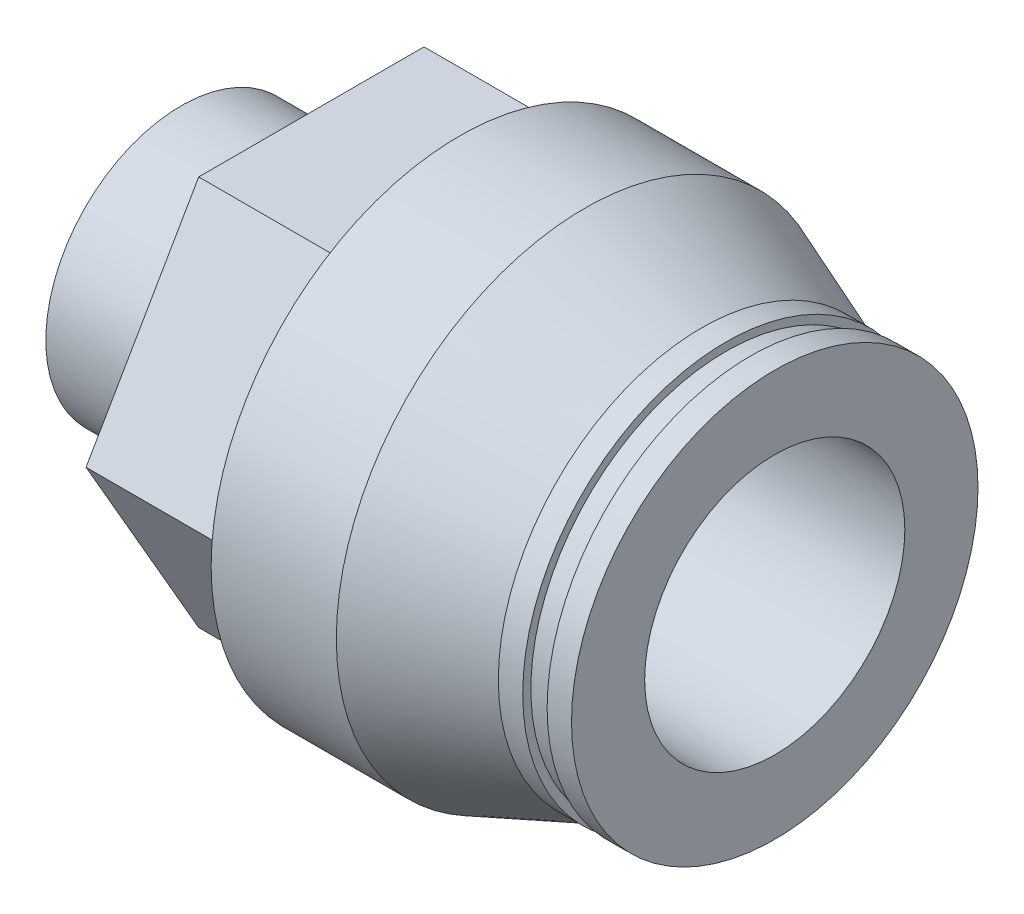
ISO-10303-21;
HEADER;
FILE_DESCRIPTION(('STEP AP214'),'2;1');
FILE_NAME('part.step','',(''),(''),'','','');
FILE_SCHEMA(('AUTOMOTIVE_DESIGN { 1 0 10303 214 1 1 1 1 }'));
ENDSEC;
DATA;
#1=APPLICATION_CONTEXT('core data for automotive mechanical design processes');
#2=APPLICATION_PROTOCOL_DEFINITION('international standard','automotive_design',2000,#1);
#3=PRODUCT_CONTEXT('',#1,'mechanical');
#4=PRODUCT('Part','Part','',(#3));
#5=PRODUCT_RELATED_PRODUCT_CATEGORY('part','',(#4));
#6=PRODUCT_DEFINITION_FORMATION('','',#4);
#7=PRODUCT_DEFINITION_CONTEXT('part definition',#1,'design');
#8=PRODUCT_DEFINITION('design','',#6,#7);
#9=PRODUCT_DEFINITION_SHAPE('','',#8);
#10=(LENGTH_UNIT() NAMED_UNIT(*) SI_UNIT(.MILLI.,.METRE.));
#11=(NAMED_UNIT(*) PLANE_ANGLE_UNIT() SI_UNIT($,.RADIAN.));
#12=(NAMED_UNIT(*) SI_UNIT($,.STERADIAN.) SOLID_ANGLE_UNIT());
#13=UNCERTAINTY_MEASURE_WITH_UNIT(LENGTH_MEASURE(1.E-05),#10,'distance_accuracy_value','');
#14=(GEOMETRIC_REPRESENTATION_CONTEXT(3) GLOBAL_UNCERTAINTY_ASSIGNED_CONTEXT((#13)) GLOBAL_UNIT_ASSIGNED_CONTEXT((#10,
#11,#12)) REPRESENTATION_CONTEXT('',''));
#15=CARTESIAN_POINT('',(0.,0.,0.));
#16=DIRECTION('',(0.,0.,1.));
#17=DIRECTION('',(1.,0.,0.));
#18=AXIS2_PLACEMENT_3D('',#15,#16,#17);
#19=CARTESIAN_POINT('',(8.,8.33,0.));
#20=DIRECTION('',(-1.,0.,0.));
#21=DIRECTION('',(0.,0.,1.));
#22=AXIS2_PLACEMENT_3D('',#19,#20,#21);
#23=PLANE('',#22);
#24=CARTESIAN_POINT('',(8.,0.,0.));
#25=DIRECTION('',(1.,0.,0.));
#26=DIRECTION('',(0.,0.,-1.));
#27=AXIS2_PLACEMENT_3D('',#24,#25,#26);
#28=CIRCLE('',#27,8.33);
#29=CARTESIAN_POINT('',(8.,0.,-8.33));
#30=VERTEX_POINT('',#29);
#31=EDGE_CURVE('E218',#30,#30,#28,.T.);
#32=ORIENTED_EDGE('',*,*,#31,.T.);
#33=EDGE_LOOP('',(#32));
#34=FACE_BOUND('',#33,.T.);
#35=DIRECTION('',(0.,-0.866025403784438,0.5));
#36=VECTOR('',#35,1.);
#37=CARTESIAN_POINT('',(8.,0.,-13.856406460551));
#38=LINE('',#37,#36);
#39=CARTESIAN_POINT('',(8.,0.,-13.856406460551));
#40=VERTEX_POINT('',#39);
#41=CARTESIAN_POINT('',(8.,-12.,-6.9282032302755));
#42=VERTEX_POINT('',#41);
#43=EDGE_CURVE('E127',#40,#42,#38,.T.);
#44=ORIENTED_EDGE('',*,*,#43,.T.);
#45=DIRECTION('',(0.,0.,1.));
#46=VECTOR('',#45,1.);
#47=CARTESIAN_POINT('',(8.,-12.,-6.9282032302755));
#48=LINE('',#47,#46);
#49=CARTESIAN_POINT('',(8.,-12.,6.92820323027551));
#50=VERTEX_POINT('',#49);
#51=EDGE_CURVE('E110',#42,#50,#48,.T.);
#52=ORIENTED_EDGE('',*,*,#51,.T.);
#53=DIRECTION('',(0.,0.866025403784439,0.5));
#54=VECTOR('',#53,1.);
#55=CARTESIAN_POINT('',(8.,-12.,6.92820323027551));
#56=LINE('',#55,#54);
#57=CARTESIAN_POINT('',(8.,0.,13.856406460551));
#58=VERTEX_POINT('',#57);
#59=EDGE_CURVE('E121',#50,#58,#56,.T.);
#60=ORIENTED_EDGE('',*,*,#59,.T.);
#61=DIRECTION('',(0.,0.866025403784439,-0.5));
#62=VECTOR('',#61,1.);
#63=CARTESIAN_POINT('',(8.,0.,13.856406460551));
#64=LINE('',#63,#62);
#65=CARTESIAN_POINT('',(8.,12.,6.92820323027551));
#66=VERTEX_POINT('',#65);
#67=EDGE_CURVE('E30',#58,#66,#64,.T.);
#68=ORIENTED_EDGE('',*,*,#67,.T.);
#69=DIRECTION('',(0.,0.,-1.));
#70=VECTOR('',#69,1.);
#71=CARTESIAN_POINT('',(8.,12.,6.92820323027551));
#72=LINE('',#71,#70);
#73=CARTESIAN_POINT('',(8.,12.,-6.92820323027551));
#74=VERTEX_POINT('',#73);
#75=EDGE_CURVE('E131',#66,#74,#72,.T.);
#76=ORIENTED_EDGE('',*,*,#75,.T.);
#77=DIRECTION('',(0.,-0.866025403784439,-0.5));
#78=VECTOR('',#77,1.);
#79=CARTESIAN_POINT('',(8.,12.,-6.92820323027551));
#80=LINE('',#79,#78);
#81=EDGE_CURVE('E134',#74,#40,#80,.T.);
#82=ORIENTED_EDGE('',*,*,#81,.T.);
#83=EDGE_LOOP('',(#44,#52,#60,#68,#76,#82));
#84=FACE_BOUND('',#83,.T.);
#85=ADVANCED_FACE('F15',(#34,#84),#23,.T.);
#86=CARTESIAN_POINT('',(0.,0.,0.));
#87=DIRECTION('',(-1.,0.,0.));
#88=DIRECTION('',(0.,0.,1.));
#89=AXIS2_PLACEMENT_3D('',#86,#87,#88);
#90=PLANE('',#89);
#91=CARTESIAN_POINT('',(0.,0.,0.));
#92=DIRECTION('',(1.,0.,0.));
#93=DIRECTION('',(0.,0.,-1.));
#94=AXIS2_PLACEMENT_3D('',#91,#92,#93);
#95=CIRCLE('',#94,8.33);
#96=CARTESIAN_POINT('',(0.,0.,-8.33));
#97=VERTEX_POINT('',#96);
#98=EDGE_CURVE('E221',#97,#97,#95,.T.);
#99=ORIENTED_EDGE('',*,*,#98,.F.);
#100=EDGE_LOOP('',(#99));
#101=FACE_BOUND('',#100,.T.);
#102=DIRECTION('',(0.,-0.866025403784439,-0.5));
#103=VECTOR('',#102,1.);
#104=CARTESIAN_POINT('',(0.,0.,4.618802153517));
#105=LINE('',#104,#103);
#106=CARTESIAN_POINT('',(0.,0.,4.618802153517));
#107=VERTEX_POINT('',#106);
#108=CARTESIAN_POINT('',(0.,-4.,2.3094010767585));
#109=VERTEX_POINT('',#108);
#110=EDGE_CURVE('E173',#107,#109,#105,.T.);
#111=ORIENTED_EDGE('',*,*,#110,.T.);
#112=DIRECTION('',(0.,0.,-1.));
#113=VECTOR('',#112,1.);
#114=CARTESIAN_POINT('',(0.,-4.,2.3094010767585));
#115=LINE('',#114,#113);
#116=CARTESIAN_POINT('',(0.,-4.,-2.30940107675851));
#117=VERTEX_POINT('',#116);
#118=EDGE_CURVE('E38',#109,#117,#115,.T.);
#119=ORIENTED_EDGE('',*,*,#118,.T.);
#120=DIRECTION('',(0.,0.866025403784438,-0.5));
#121=VECTOR('',#120,1.);
#122=CARTESIAN_POINT('',(0.,-4.,-2.30940107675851));
#123=LINE('',#122,#121);
#124=CARTESIAN_POINT('',(0.,0.,-4.61880215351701));
#125=VERTEX_POINT('',#124);
#126=EDGE_CURVE('E161',#117,#125,#123,.T.);
#127=ORIENTED_EDGE('',*,*,#126,.T.);
#128=DIRECTION('',(0.,0.866025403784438,0.5));
#129=VECTOR('',#128,1.);
#130=CARTESIAN_POINT('',(0.,0.,-4.61880215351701));
#131=LINE('',#130,#129);
#132=CARTESIAN_POINT('',(0.,4.,-2.3094010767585));
#133=VERTEX_POINT('',#132);
#134=EDGE_CURVE('E164',#125,#133,#131,.T.);
#135=ORIENTED_EDGE('',*,*,#134,.T.);
#136=DIRECTION('',(0.,0.,1.));
#137=VECTOR('',#136,1.);
#138=CARTESIAN_POINT('',(0.,4.,-2.3094010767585));
#139=LINE('',#138,#137);
#140=CARTESIAN_POINT('',(0.,4.,2.3094010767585));
#141=VERTEX_POINT('',#140);
#142=EDGE_CURVE('E167',#133,#141,#139,.T.);
#143=ORIENTED_EDGE('',*,*,#142,.T.);
#144=DIRECTION('',(0.,-0.866025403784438,0.5));
#145=VECTOR('',#144,1.);
#146=CARTESIAN_POINT('',(0.,4.,2.3094010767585));
#147=LINE('',#146,#145);
#148=EDGE_CURVE('E170',#141,#107,#147,.T.);
#149=ORIENTED_EDGE('',*,*,#148,.T.);
#150=EDGE_LOOP('',(#111,#119,#127,#135,#143,#149));
#151=FACE_BOUND('',#150,.T.);
#152=ADVANCED_FACE('F17',(#101,#151),#90,.T.);
#153=CARTESIAN_POINT('',(11.5,8.,0.));
#154=DIRECTION('',(1.,0.,0.));
#155=DIRECTION('',(0.,0.,-1.));
#156=AXIS2_PLACEMENT_3D('',#153,#154,#155);
#157=PLANE('',#156);
#158=CARTESIAN_POINT('',(11.5,0.,0.));
#159=DIRECTION('',(1.,0.,0.));
#160=DIRECTION('',(0.,0.,-1.));
#161=AXIS2_PLACEMENT_3D('',#158,#159,#160);
#162=CIRCLE('',#161,8.);
#163=CARTESIAN_POINT('',(11.5,0.,-8.));
#164=VERTEX_POINT('',#163);
#165=EDGE_CURVE('E188',#164,#164,#162,.T.);
#166=ORIENTED_EDGE('',*,*,#165,.T.);
#167=EDGE_LOOP('',(#166));
#168=FACE_BOUND('',#167,.T.);
#169=DIRECTION('',(0.,-0.866025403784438,0.5));
#170=VECTOR('',#169,1.);
#171=CARTESIAN_POINT('',(11.5,3.99999999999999,-6.92820323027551));
#172=LINE('',#171,#170);
#173=CARTESIAN_POINT('',(11.5,0.,-4.61880215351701));
#174=VERTEX_POINT('',#173);
#175=CARTESIAN_POINT('',(11.5,-4.,-2.30940107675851));
#176=VERTEX_POINT('',#175);
#177=EDGE_CURVE('E23',#174,#176,#172,.T.);
#178=ORIENTED_EDGE('',*,*,#177,.T.);
#179=DIRECTION('',(0.,0.,1.));
#180=VECTOR('',#179,1.);
#181=CARTESIAN_POINT('',(11.5,-4.,0.));
#182=LINE('',#181,#180);
#183=CARTESIAN_POINT('',(11.5,-4.,2.3094010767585));
#184=VERTEX_POINT('',#183);
#185=EDGE_CURVE('E9',#176,#184,#182,.T.);
#186=ORIENTED_EDGE('',*,*,#185,.T.);
#187=DIRECTION('',(0.,0.866025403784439,0.5));
#188=VECTOR('',#187,1.);
#189=CARTESIAN_POINT('',(11.5,4.,6.92820323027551));
#190=LINE('',#189,#188);
#191=CARTESIAN_POINT('',(11.5,0.,4.618802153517));
#192=VERTEX_POINT('',#191);
#193=EDGE_CURVE('E224',#184,#192,#190,.T.);
#194=ORIENTED_EDGE('',*,*,#193,.T.);
#195=DIRECTION('',(0.,0.866025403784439,-0.5));
#196=VECTOR('',#195,1.);
#197=CARTESIAN_POINT('',(11.5,8.,0.));
#198=LINE('',#197,#196);
#199=CARTESIAN_POINT('',(11.5,4.,2.3094010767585));
#200=VERTEX_POINT('',#199);
#201=EDGE_CURVE('E227',#192,#200,#198,.T.);
#202=ORIENTED_EDGE('',*,*,#201,.T.);
#203=DIRECTION('',(0.,0.,-1.));
#204=VECTOR('',#203,1.);
#205=CARTESIAN_POINT('',(11.5,4.,0.));
#206=LINE('',#205,#204);
#207=CARTESIAN_POINT('',(11.5,4.,-2.3094010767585));
#208=VERTEX_POINT('',#207);
#209=EDGE_CURVE('E230',#200,#208,#206,.T.);
#210=ORIENTED_EDGE('',*,*,#209,.T.);
#211=DIRECTION('',(0.,-0.866025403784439,-0.5));
#212=VECTOR('',#211,1.);
#213=CARTESIAN_POINT('',(11.5,8.,0.));
#214=LINE('',#213,#212);
#215=EDGE_CURVE('E233',#208,#174,#214,.T.);
#216=ORIENTED_EDGE('',*,*,#215,.T.);
#217=EDGE_LOOP('',(#178,#186,#194,#202,#210,#216));
#218=FACE_BOUND('',#217,.T.);
#219=ADVANCED_FACE('F237',(#168,#218),#157,.T.);
#220=CARTESIAN_POINT('',(0.,0.,0.));
#221=DIRECTION('',(1.,0.,0.));
#222=DIRECTION('',(0.,0.,-1.));
#223=AXIS2_PLACEMENT_3D('',#220,#221,#222);
#224=CYLINDRICAL_SURFACE('',#223,8.33);
#225=ORIENTED_EDGE('',*,*,#98,.T.);
#226=EDGE_LOOP('',(#225));
#227=FACE_BOUND('',#226,.T.);
#228=ORIENTED_EDGE('',*,*,#31,.F.);
#229=EDGE_LOOP('',(#228));
#230=FACE_BOUND('',#229,.T.);
#231=ADVANCED_FACE('F279',(#227,#230),#224,.T.);
#232=CARTESIAN_POINT('',(17.125,14.,0.));
#233=DIRECTION('',(-1.,0.,0.));
#234=DIRECTION('',(0.,0.,1.));
#235=AXIS2_PLACEMENT_3D('',#232,#233,#234);
#236=PLANE('',#235);
#237=CARTESIAN_POINT('',(17.125,0.,0.));
#238=DIRECTION('',(1.,0.,0.));
#239=DIRECTION('',(0.,0.,-1.));
#240=AXIS2_PLACEMENT_3D('',#237,#238,#239);
#241=CIRCLE('',#240,15.2875847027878);
#242=CARTESIAN_POINT('',(17.125,0.,-15.2875847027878));
#243=VERTEX_POINT('',#242);
#244=EDGE_CURVE('E215',#243,#243,#241,.T.);
#245=ORIENTED_EDGE('',*,*,#244,.F.);
#246=EDGE_LOOP('',(#245));
#247=FACE_BOUND('',#246,.T.);
#248=DIRECTION('',(0.,-0.866025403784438,0.5));
#249=VECTOR('',#248,1.);
#250=CARTESIAN_POINT('',(17.125,0.,-13.856406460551));
#251=LINE('',#250,#249);
#252=CARTESIAN_POINT('',(17.125,0.,-13.856406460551));
#253=VERTEX_POINT('',#252);
#254=CARTESIAN_POINT('',(17.125,-12.,-6.9282032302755));
#255=VERTEX_POINT('',#254);
#256=EDGE_CURVE('E118',#253,#255,#251,.T.);
#257=ORIENTED_EDGE('',*,*,#256,.F.);
#258=DIRECTION('',(0.,-0.866025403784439,-0.5));
#259=VECTOR('',#258,1.);
#260=CARTESIAN_POINT('',(17.125,12.,-6.92820323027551));
#261=LINE('',#260,#259);
#262=CARTESIAN_POINT('',(17.125,12.,-6.92820323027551));
#263=VERTEX_POINT('',#262);
#264=EDGE_CURVE('E146',#263,#253,#261,.T.);
#265=ORIENTED_EDGE('',*,*,#264,.F.);
#266=DIRECTION('',(0.,0.,-1.));
#267=VECTOR('',#266,1.);
#268=CARTESIAN_POINT('',(17.125,12.,6.92820323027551));
#269=LINE('',#268,#267);
#270=CARTESIAN_POINT('',(17.125,12.,6.92820323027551));
#271=VERTEX_POINT('',#270);
#272=EDGE_CURVE('E143',#271,#263,#269,.T.);
#273=ORIENTED_EDGE('',*,*,#272,.F.);
#274=DIRECTION('',(0.,0.866025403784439,-0.5));
#275=VECTOR('',#274,1.);
#276=CARTESIAN_POINT('',(17.125,0.,13.856406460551));
#277=LINE('',#276,#275);
#278=CARTESIAN_POINT('',(17.125,0.,13.856406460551));
#279=VERTEX_POINT('',#278);
#280=EDGE_CURVE('E140',#279,#271,#277,.T.);
#281=ORIENTED_EDGE('',*,*,#280,.F.);
#282=DIRECTION('',(0.,0.866025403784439,0.5));
#283=VECTOR('',#282,1.);
#284=CARTESIAN_POINT('',(17.125,-12.,6.92820323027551));
#285=LINE('',#284,#283);
#286=CARTESIAN_POINT('',(17.125,-12.,6.92820323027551));
#287=VERTEX_POINT('',#286);
#288=EDGE_CURVE('E138',#287,#279,#285,.T.);
#289=ORIENTED_EDGE('',*,*,#288,.F.);
#290=DIRECTION('',(0.,0.,1.));
#291=VECTOR('',#290,1.);
#292=CARTESIAN_POINT('',(17.125,-12.,-6.9282032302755));
#293=LINE('',#292,#291);
#294=EDGE_CURVE('E113',#255,#287,#293,.T.);
#295=ORIENTED_EDGE('',*,*,#294,.F.);
#296=EDGE_LOOP('',(#257,#265,#273,#281,#289,#295));
#297=FACE_BOUND('',#296,.T.);
#298=ADVANCED_FACE('F277',(#247,#297),#236,.T.);
#299=CARTESIAN_POINT('',(0.,0.,0.));
#300=DIRECTION('',(1.,0.,0.));
#301=DIRECTION('',(0.,0.,-1.));
#302=AXIS2_PLACEMENT_3D('',#299,#300,#301);
#303=CYLINDRICAL_SURFACE('',#302,15.2875847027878);
#304=ORIENTED_EDGE('',*,*,#244,.T.);
#305=EDGE_LOOP('',(#304));
#306=FACE_BOUND('',#305,.T.);
#307=CARTESIAN_POINT('',(24.8236975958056,0.,0.));
#308=DIRECTION('',(1.,0.,0.));
#309=DIRECTION('',(0.,0.,-1.));
#310=AXIS2_PLACEMENT_3D('',#307,#308,#309);
#311=CIRCLE('',#310,15.2875847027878);
#312=CARTESIAN_POINT('',(24.8236975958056,0.,-15.2875847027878));
#313=VERTEX_POINT('',#312);
#314=EDGE_CURVE('E212',#313,#313,#311,.T.);
#315=ORIENTED_EDGE('',*,*,#314,.F.);
#316=EDGE_LOOP('',(#315));
#317=FACE_BOUND('',#316,.T.);
#318=ADVANCED_FACE('F286',(#306,#317),#303,.T.);
#319=CARTESIAN_POINT('',(32.,0.,0.));
#320=DIRECTION('',(-1.,0.,0.));
#321=DIRECTION('',(0.,0.,1.));
#322=AXIS2_PLACEMENT_3D('',#319,#320,#321);
#323=CONICAL_SURFACE('',#322,12.5,0.370503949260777);
#324=ORIENTED_EDGE('',*,*,#314,.T.);
#325=EDGE_LOOP('',(#324));
#326=FACE_BOUND('',#325,.T.);
#327=CARTESIAN_POINT('',(32.,0.,0.));
#328=DIRECTION('',(1.,0.,0.));
#329=DIRECTION('',(0.,0.,-1.));
#330=AXIS2_PLACEMENT_3D('',#327,#328,#329);
#331=CIRCLE('',#330,12.5);
#332=CARTESIAN_POINT('',(32.,0.,-12.5));
#333=VERTEX_POINT('',#332);
#334=EDGE_CURVE('E209',#333,#333,#331,.T.);
#335=ORIENTED_EDGE('',*,*,#334,.F.);
#336=EDGE_LOOP('',(#335));
#337=FACE_BOUND('',#336,.T.);
#338=ADVANCED_FACE('F317',(#326,#337),#323,.T.);
#339=CARTESIAN_POINT('',(0.,0.,0.));
#340=DIRECTION('',(1.,0.,0.));
#341=DIRECTION('',(0.,0.,-1.));
#342=AXIS2_PLACEMENT_3D('',#339,#340,#341);
#343=CYLINDRICAL_SURFACE('',#342,12.5);
#344=ORIENTED_EDGE('',*,*,#334,.T.);
#345=EDGE_LOOP('',(#344));
#346=FACE_BOUND('',#345,.T.);
#347=CARTESIAN_POINT('',(33.5,0.,0.));
#348=DIRECTION('',(1.,0.,0.));
#349=DIRECTION('',(0.,0.,-1.));
#350=AXIS2_PLACEMENT_3D('',#347,#348,#349);
#351=CIRCLE('',#350,12.5);
#352=CARTESIAN_POINT('',(33.5,0.,-12.5));
#353=VERTEX_POINT('',#352);
#354=EDGE_CURVE('E206',#353,#353,#351,.T.);
#355=ORIENTED_EDGE('',*,*,#354,.F.);
#356=EDGE_LOOP('',(#355));
#357=FACE_BOUND('',#356,.T.);
#358=ADVANCED_FACE('F313',(#346,#357),#343,.T.);
#359=CARTESIAN_POINT('',(33.5,12.5,0.));
#360=DIRECTION('',(1.,0.,0.));
#361=DIRECTION('',(0.,0.,-1.));
#362=AXIS2_PLACEMENT_3D('',#359,#360,#361);
#363=PLANE('',#362);
#364=ORIENTED_EDGE('',*,*,#354,.T.);
#365=EDGE_LOOP('',(#364));
#366=FACE_BOUND('',#365,.T.);
#367=CARTESIAN_POINT('',(33.5,0.,0.));
#368=DIRECTION('',(1.,0.,0.));
#369=DIRECTION('',(0.,0.,-1.));
#370=AXIS2_PLACEMENT_3D('',#367,#368,#369);
#371=CIRCLE('',#370,12.);
#372=CARTESIAN_POINT('',(33.5,0.,-12.));
#373=VERTEX_POINT('',#372);
#374=EDGE_CURVE('E203',#373,#373,#371,.T.);
#375=ORIENTED_EDGE('',*,*,#374,.F.);
#376=EDGE_LOOP('',(#375));
#377=FACE_BOUND('',#376,.T.);
#378=ADVANCED_FACE('F309',(#366,#377),#363,.T.);
#379=CARTESIAN_POINT('',(0.,0.,0.));
#380=DIRECTION('',(1.,0.,0.));
#381=DIRECTION('',(0.,0.,-1.));
#382=AXIS2_PLACEMENT_3D('',#379,#380,#381);
#383=CYLINDRICAL_SURFACE('',#382,12.);
#384=ORIENTED_EDGE('',*,*,#374,.T.);
#385=EDGE_LOOP('',(#384));
#386=FACE_BOUND('',#385,.T.);
#387=CARTESIAN_POINT('',(35.,0.,0.));
#388=DIRECTION('',(1.,0.,0.));
#389=DIRECTION('',(0.,0.,-1.));
#390=AXIS2_PLACEMENT_3D('',#387,#388,#389);
#391=CIRCLE('',#390,12.);
#392=CARTESIAN_POINT('',(35.,0.,-12.));
#393=VERTEX_POINT('',#392);
#394=EDGE_CURVE('E200',#393,#393,#391,.T.);
#395=ORIENTED_EDGE('',*,*,#394,.F.);
#396=EDGE_LOOP('',(#395));
#397=FACE_BOUND('',#396,.T.);
#398=ADVANCED_FACE('F305',(#386,#397),#383,.T.);
#399=CARTESIAN_POINT('',(35.,12.,0.));
#400=DIRECTION('',(-1.,0.,0.));
#401=DIRECTION('',(0.,0.,1.));
#402=AXIS2_PLACEMENT_3D('',#399,#400,#401);
#403=PLANE('',#402);
#404=ORIENTED_EDGE('',*,*,#394,.T.);
#405=EDGE_LOOP('',(#404));
#406=FACE_BOUND('',#405,.T.);
#407=CARTESIAN_POINT('',(35.,0.,0.));
#408=DIRECTION('',(1.,0.,0.));
#409=DIRECTION('',(0.,0.,-1.));
#410=AXIS2_PLACEMENT_3D('',#407,#408,#409);
#411=CIRCLE('',#410,12.5);
#412=CARTESIAN_POINT('',(35.,0.,-12.5));
#413=VERTEX_POINT('',#412);
#414=EDGE_CURVE('E197',#413,#413,#411,.T.);
#415=ORIENTED_EDGE('',*,*,#414,.F.);
#416=EDGE_LOOP('',(#415));
#417=FACE_BOUND('',#416,.T.);
#418=ADVANCED_FACE('F301',(#406,#417),#403,.T.);
#419=CARTESIAN_POINT('',(0.,0.,0.));
#420=DIRECTION('',(1.,0.,0.));
#421=DIRECTION('',(0.,0.,-1.));
#422=AXIS2_PLACEMENT_3D('',#419,#420,#421);
#423=CYLINDRICAL_SURFACE('',#422,12.5);
#424=ORIENTED_EDGE('',*,*,#414,.T.);
#425=EDGE_LOOP('',(#424));
#426=FACE_BOUND('',#425,.T.);
#427=CARTESIAN_POINT('',(36.5,0.,0.));
#428=DIRECTION('',(1.,0.,0.));
#429=DIRECTION('',(0.,0.,-1.));
#430=AXIS2_PLACEMENT_3D('',#427,#428,#429);
#431=CIRCLE('',#430,12.5);
#432=CARTESIAN_POINT('',(36.5,0.,-12.5));
#433=VERTEX_POINT('',#432);
#434=EDGE_CURVE('E194',#433,#433,#431,.T.);
#435=ORIENTED_EDGE('',*,*,#434,.F.);
#436=EDGE_LOOP('',(#435));
#437=FACE_BOUND('',#436,.T.);
#438=ADVANCED_FACE('F297',(#426,#437),#423,.T.);
#439=CARTESIAN_POINT('',(36.5,12.5,0.));
#440=DIRECTION('',(1.,0.,0.));
#441=DIRECTION('',(0.,0.,-1.));
#442=AXIS2_PLACEMENT_3D('',#439,#440,#441);
#443=PLANE('',#442);
#444=ORIENTED_EDGE('',*,*,#434,.T.);
#445=EDGE_LOOP('',(#444));
#446=FACE_BOUND('',#445,.T.);
#447=CARTESIAN_POINT('',(36.5,0.,0.));
#448=DIRECTION('',(1.,0.,0.));
#449=DIRECTION('',(0.,0.,-1.));
#450=AXIS2_PLACEMENT_3D('',#447,#448,#449);
#451=CIRCLE('',#450,8.);
#452=CARTESIAN_POINT('',(36.5,0.,-8.));
#453=VERTEX_POINT('',#452);
#454=EDGE_CURVE('E191',#453,#453,#451,.T.);
#455=ORIENTED_EDGE('',*,*,#454,.F.);
#456=EDGE_LOOP('',(#455));
#457=FACE_BOUND('',#456,.T.);
#458=ADVANCED_FACE('F265',(#446,#457),#443,.T.);
#459=CARTESIAN_POINT('',(0.,0.,0.));
#460=DIRECTION('',(1.,0.,0.));
#461=DIRECTION('',(0.,0.,-1.));
#462=AXIS2_PLACEMENT_3D('',#459,#460,#461);
#463=CYLINDRICAL_SURFACE('',#462,8.);
#464=ORIENTED_EDGE('',*,*,#454,.T.);
#465=EDGE_LOOP('',(#464));
#466=FACE_BOUND('',#465,.T.);
#467=ORIENTED_EDGE('',*,*,#165,.F.);
#468=EDGE_LOOP('',(#467));
#469=FACE_BOUND('',#468,.T.);
#470=ADVANCED_FACE('F256',(#466,#469),#463,.F.);
#471=CARTESIAN_POINT('',(36.5,-4.,2.3094010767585));
#472=DIRECTION('',(0.,1.,0.));
#473=DIRECTION('',(0.,0.,1.));
#474=AXIS2_PLACEMENT_3D('',#471,#472,#473);
#475=PLANE('',#474);
#476=DIRECTION('',(-1.,0.,0.));
#477=VECTOR('',#476,1.);
#478=CARTESIAN_POINT('',(36.5,-4.,-2.30940107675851));
#479=LINE('',#478,#477);
#480=EDGE_CURVE('E186',#176,#117,#479,.T.);
#481=ORIENTED_EDGE('',*,*,#480,.T.);
#482=ORIENTED_EDGE('',*,*,#118,.F.);
#483=DIRECTION('',(-1.,0.,0.));
#484=VECTOR('',#483,1.);
#485=CARTESIAN_POINT('',(36.5,-4.,2.3094010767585));
#486=LINE('',#485,#484);
#487=EDGE_CURVE('E176',#184,#109,#486,.T.);
#488=ORIENTED_EDGE('',*,*,#487,.F.);
#489=ORIENTED_EDGE('',*,*,#185,.F.);
#490=EDGE_LOOP('',(#481,#482,#488,#489));
#491=FACE_BOUND('',#490,.T.);
#492=ADVANCED_FACE('F254',(#491),#475,.T.);
#493=CARTESIAN_POINT('',(36.5,-4.,-2.30940107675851));
#494=DIRECTION('',(0.,0.5,0.866025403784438));
#495=DIRECTION('',(0.,-0.866025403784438,0.5));
#496=AXIS2_PLACEMENT_3D('',#493,#494,#495);
#497=PLANE('',#496);
#498=DIRECTION('',(-1.,0.,0.));
#499=VECTOR('',#498,1.);
#500=CARTESIAN_POINT('',(36.5,0.,-4.61880215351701));
#501=LINE('',#500,#499);
#502=EDGE_CURVE('E184',#174,#125,#501,.T.);
#503=ORIENTED_EDGE('',*,*,#502,.T.);
#504=ORIENTED_EDGE('',*,*,#126,.F.);
#505=ORIENTED_EDGE('',*,*,#480,.F.);
#506=ORIENTED_EDGE('',*,*,#177,.F.);
#507=EDGE_LOOP('',(#503,#504,#505,#506));
#508=FACE_BOUND('',#507,.T.);
#509=ADVANCED_FACE('F241',(#508),#497,.T.);
#510=CARTESIAN_POINT('',(36.5,0.,-4.61880215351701));
#511=DIRECTION('',(0.,-0.5,0.866025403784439));
#512=DIRECTION('',(0.,-0.866025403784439,-0.5));
#513=AXIS2_PLACEMENT_3D('',#510,#511,#512);
#514=PLANE('',#513);
#515=DIRECTION('',(-1.,0.,0.));
#516=VECTOR('',#515,1.);
#517=CARTESIAN_POINT('',(36.5,4.,-2.3094010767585));
#518=LINE('',#517,#516);
#519=EDGE_CURVE('E182',#208,#133,#518,.T.);
#520=ORIENTED_EDGE('',*,*,#519,.T.);
#521=ORIENTED_EDGE('',*,*,#134,.F.);
#522=ORIENTED_EDGE('',*,*,#502,.F.);
#523=ORIENTED_EDGE('',*,*,#215,.F.);
#524=EDGE_LOOP('',(#520,#521,#522,#523));
#525=FACE_BOUND('',#524,.T.);
#526=ADVANCED_FACE('F245',(#525),#514,.T.);
#527=CARTESIAN_POINT('',(36.5,4.,-2.3094010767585));
#528=DIRECTION('',(0.,-1.,0.));
#529=DIRECTION('',(0.,0.,-1.));
#530=AXIS2_PLACEMENT_3D('',#527,#528,#529);
#531=PLANE('',#530);
#532=DIRECTION('',(-1.,0.,0.));
#533=VECTOR('',#532,1.);
#534=CARTESIAN_POINT('',(36.5,4.,2.3094010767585));
#535=LINE('',#534,#533);
#536=EDGE_CURVE('E180',#200,#141,#535,.T.);
#537=ORIENTED_EDGE('',*,*,#536,.T.);
#538=ORIENTED_EDGE('',*,*,#142,.F.);
#539=ORIENTED_EDGE('',*,*,#519,.F.);
#540=ORIENTED_EDGE('',*,*,#209,.F.);
#541=EDGE_LOOP('',(#537,#538,#539,#540));
#542=FACE_BOUND('',#541,.T.);
#543=ADVANCED_FACE('F374',(#542),#531,.T.);
#544=CARTESIAN_POINT('',(36.5,4.,2.3094010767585));
#545=DIRECTION('',(0.,-0.5,-0.866025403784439));
#546=DIRECTION('',(0.,0.866025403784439,-0.5));
#547=AXIS2_PLACEMENT_3D('',#544,#545,#546);
#548=PLANE('',#547);
#549=DIRECTION('',(-1.,0.,0.));
#550=VECTOR('',#549,1.);
#551=CARTESIAN_POINT('',(36.5,0.,4.618802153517));
#552=LINE('',#551,#550);
#553=EDGE_CURVE('E178',#192,#107,#552,.T.);
#554=ORIENTED_EDGE('',*,*,#553,.T.);
#555=ORIENTED_EDGE('',*,*,#148,.F.);
#556=ORIENTED_EDGE('',*,*,#536,.F.);
#557=ORIENTED_EDGE('',*,*,#201,.F.);
#558=EDGE_LOOP('',(#554,#555,#556,#557));
#559=FACE_BOUND('',#558,.T.);
#560=ADVANCED_FACE('F371',(#559),#548,.T.);
#561=CARTESIAN_POINT('',(36.5,0.,4.618802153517));
#562=DIRECTION('',(0.,0.5,-0.866025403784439));
#563=DIRECTION('',(0.,0.866025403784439,0.5));
#564=AXIS2_PLACEMENT_3D('',#561,#562,#563);
#565=PLANE('',#564);
#566=ORIENTED_EDGE('',*,*,#487,.T.);
#567=ORIENTED_EDGE('',*,*,#110,.F.);
#568=ORIENTED_EDGE('',*,*,#553,.F.);
#569=ORIENTED_EDGE('',*,*,#193,.F.);
#570=EDGE_LOOP('',(#566,#567,#568,#569));
#571=FACE_BOUND('',#570,.T.);
#572=ADVANCED_FACE('F252',(#571),#565,.T.);
#573=CARTESIAN_POINT('',(17.125,-12.,-6.9282032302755));
#574=DIRECTION('',(0.,-1.,0.));
#575=DIRECTION('',(0.,0.,-1.));
#576=AXIS2_PLACEMENT_3D('',#573,#574,#575);
#577=PLANE('',#576);
#578=DIRECTION('',(-1.,0.,0.));
#579=VECTOR('',#578,1.);
#580=CARTESIAN_POINT('',(17.125,-12.,-6.9282032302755));
#581=LINE('',#580,#579);
#582=EDGE_CURVE('E151',#255,#42,#581,.T.);
#583=ORIENTED_EDGE('',*,*,#582,.F.);
#584=ORIENTED_EDGE('',*,*,#294,.T.);
#585=DIRECTION('',(-1.,0.,0.));
#586=VECTOR('',#585,1.);
#587=CARTESIAN_POINT('',(17.125,-12.,6.92820323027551));
#588=LINE('',#587,#586);
#589=EDGE_CURVE('E106',#287,#50,#588,.T.);
#590=ORIENTED_EDGE('',*,*,#589,.T.);
#591=ORIENTED_EDGE('',*,*,#51,.F.);
#592=EDGE_LOOP('',(#583,#584,#590,#591));
#593=FACE_BOUND('',#592,.T.);
#594=ADVANCED_FACE('F108',(#593),#577,.T.);
#595=CARTESIAN_POINT('',(17.125,0.,-13.856406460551));
#596=DIRECTION('',(0.,-0.5,-0.866025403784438));
#597=DIRECTION('',(0.,0.866025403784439,-0.5));
#598=AXIS2_PLACEMENT_3D('',#595,#596,#597);
#599=PLANE('',#598);
#600=DIRECTION('',(-1.,0.,0.));
#601=VECTOR('',#600,1.);
#602=CARTESIAN_POINT('',(17.125,0.,-13.856406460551));
#603=LINE('',#602,#601);
#604=EDGE_CURVE('E153',#253,#40,#603,.T.);
#605=ORIENTED_EDGE('',*,*,#604,.F.);
#606=ORIENTED_EDGE('',*,*,#256,.T.);
#607=ORIENTED_EDGE('',*,*,#582,.T.);
#608=ORIENTED_EDGE('',*,*,#43,.F.);
#609=EDGE_LOOP('',(#605,#606,#607,#608));
#610=FACE_BOUND('',#609,.T.);
#611=ADVANCED_FACE('F368',(#610),#599,.T.);
#612=CARTESIAN_POINT('',(17.125,12.,-6.92820323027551));
#613=DIRECTION('',(0.,0.5,-0.866025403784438));
#614=DIRECTION('',(0.,0.866025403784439,0.5));
#615=AXIS2_PLACEMENT_3D('',#612,#613,#614);
#616=PLANE('',#615);
#617=DIRECTION('',(-1.,0.,0.));
#618=VECTOR('',#617,1.);
#619=CARTESIAN_POINT('',(17.125,12.,-6.92820323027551));
#620=LINE('',#619,#618);
#621=EDGE_CURVE('E155',#263,#74,#620,.T.);
#622=ORIENTED_EDGE('',*,*,#621,.F.);
#623=ORIENTED_EDGE('',*,*,#264,.T.);
#624=ORIENTED_EDGE('',*,*,#604,.T.);
#625=ORIENTED_EDGE('',*,*,#81,.F.);
#626=EDGE_LOOP('',(#622,#623,#624,#625));
#627=FACE_BOUND('',#626,.T.);
#628=ADVANCED_FACE('F350',(#627),#616,.T.);
#629=CARTESIAN_POINT('',(17.125,12.,6.92820323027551));
#630=DIRECTION('',(0.,1.,0.));
#631=DIRECTION('',(0.,0.,1.));
#632=AXIS2_PLACEMENT_3D('',#629,#630,#631);
#633=PLANE('',#632);
#634=DIRECTION('',(-1.,0.,0.));
#635=VECTOR('',#634,1.);
#636=CARTESIAN_POINT('',(17.125,12.,6.92820323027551));
#637=LINE('',#636,#635);
#638=EDGE_CURVE('E157',#271,#66,#637,.T.);
#639=ORIENTED_EDGE('',*,*,#638,.F.);
#640=ORIENTED_EDGE('',*,*,#272,.T.);
#641=ORIENTED_EDGE('',*,*,#621,.T.);
#642=ORIENTED_EDGE('',*,*,#75,.F.);
#643=EDGE_LOOP('',(#639,#640,#641,#642));
#644=FACE_BOUND('',#643,.T.);
#645=ADVANCED_FACE('F354',(#644),#633,.T.);
#646=CARTESIAN_POINT('',(17.125,0.,13.856406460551));
#647=DIRECTION('',(0.,0.5,0.866025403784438));
#648=DIRECTION('',(0.,-0.866025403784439,0.5));
#649=AXIS2_PLACEMENT_3D('',#646,#647,#648);
#650=PLANE('',#649);
#651=DIRECTION('',(-1.,0.,0.));
#652=VECTOR('',#651,1.);
#653=CARTESIAN_POINT('',(17.125,0.,13.856406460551));
#654=LINE('',#653,#652);
#655=EDGE_CURVE('E117',#279,#58,#654,.T.);
#656=ORIENTED_EDGE('',*,*,#655,.F.);
#657=ORIENTED_EDGE('',*,*,#280,.T.);
#658=ORIENTED_EDGE('',*,*,#638,.T.);
#659=ORIENTED_EDGE('',*,*,#67,.F.);
#660=EDGE_LOOP('',(#656,#657,#658,#659));
#661=FACE_BOUND('',#660,.T.);
#662=ADVANCED_FACE('F355',(#661),#650,.T.);
#663=CARTESIAN_POINT('',(17.125,-12.,6.92820323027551));
#664=DIRECTION('',(0.,-0.5,0.866025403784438));
#665=DIRECTION('',(0.,-0.866025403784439,-0.5));
#666=AXIS2_PLACEMENT_3D('',#663,#664,#665);
#667=PLANE('',#666);
#668=ORIENTED_EDGE('',*,*,#589,.F.);
#669=ORIENTED_EDGE('',*,*,#288,.T.);
#670=ORIENTED_EDGE('',*,*,#655,.T.);
#671=ORIENTED_EDGE('',*,*,#59,.F.);
#672=EDGE_LOOP('',(#668,#669,#670,#671));
#673=FACE_BOUND('',#672,.T.);
#674=ADVANCED_FACE('F122',(#673),#667,.T.);
#675=CLOSED_SHELL('',(#85,#152,#219,#231,#298,#318,#338,#358,#378,#398,#418,#438,#458,#470,#492,
#509,#526,#543,#560,#572,#594,#611,#628,#645,#662,#674));
#676=MANIFOLD_SOLID_BREP('B1',#675);
#677=ADVANCED_BREP_SHAPE_REPRESENTATION('',(#18,#676),#14);
#678=SHAPE_DEFINITION_REPRESENTATION(#9,#677);
ENDSEC;
END-ISO-10303-21;
